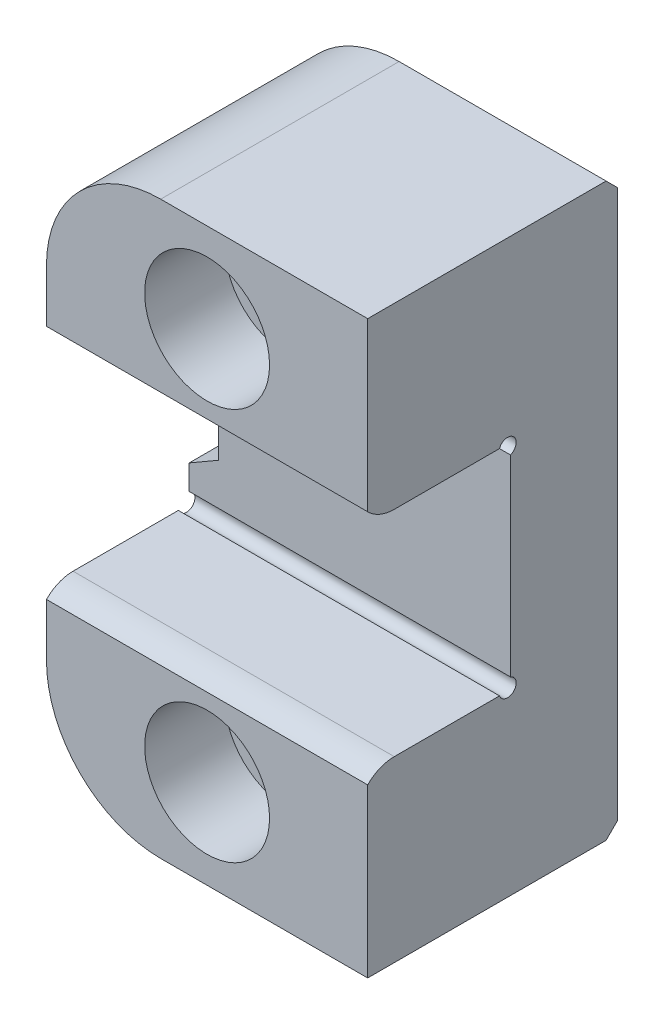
from build123d import *

# Parameters (mm, degrees)
EXTRUDE1_DEPTH             = 14.2875
FILLET1_R                  = 10.16
CUT_EXTRUDE1_DEPTH         = 41.411152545
CUT_EXTRUDE2_DEPTH         = 45.22263278
SKETCH6_R                  = 0.762
CUT_EXTRUDE3_DEPTH         = 45.22263278
F_1_4_20_CBORE_D           = 7.14248
F_1_4_20_CBORE_CBORE_D     = 11.1125
F_1_4_20_CBORE_CBORE_DEPTH = 7.14375
CHAMFER3_SIZE              = 3.81
CHAMFER3_SIZE2             = 1.020886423
CHAMFER1_SIZE              = 1.016


with BuildPart() as part:
    # Sketch1 → Extrude1 (new, symmetric)
    with BuildSketch(Plane(origin=(0, 0, 0), x_dir=(0, 0, -1), z_dir=(1, 0, 0))):
        Polygon((0, 9.525), (12.7, 9.525), (12.7, -9.525), (0, -9.525), (0, -25.4), (22.225, -25.4), (22.225, 25.4), (0, 25.4), align=None)
    extrude(amount=EXTRUDE1_DEPTH, both=True)

    # Fillet1
    fillet1_edges = [part.edges().sort_by_distance(p)[0] for p in [
        (-14.2875, 25.4, -11.1125),
        (-14.2875, -25.4, -11.1125),
    ]]
    fillet(fillet1_edges, radius=FILLET1_R)

    # Sketch2 → Cut-Extrude1 (cut, through all)
    with BuildSketch(Plane(origin=(-7.9375, 0, -22.225), x_dir=(1, 0, 0), z_dir=(0, 0, 1))):
        Polygon((-7.9375, 7.266543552), (-7.9375, -7.266543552), (-4.7625, -5.433456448), (-4.7625, 5.433456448), align=None)
    extrude(amount=CUT_EXTRUDE1_DEPTH, mode=Mode.SUBTRACT)

    # Sketch5 → Cut-Extrude2 (cut, through all)
    with BuildSketch(Plane(origin=(14.2875, 0, 0), x_dir=(0, 0, -1), z_dir=(1, 0, 0))):
        with BuildLine():
            Line((-3.9878, -7.346019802), (2.3622, -7.346019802))
            Line((2.3622, -7.346019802), (2.3622, -9.525))
            ThreePointArc((2.3622, -9.525), (1.080400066, -9.78418595), (0, -10.521019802))
            Line((0, -10.521019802), (-3.9878, -10.521019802))
            Line((-3.9878, -10.521019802), (-3.9878, -7.346019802))
        make_face()
        with BuildLine():
            Line((2.3622, 7.346019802), (2.3622, 9.525))
            ThreePointArc((2.3622, 9.525), (1.080400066, 9.78418595), (0, 10.521019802))
            Line((0, 10.521019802), (-3.9878, 10.521019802))
            Line((-3.9878, 10.521019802), (-3.9878, 7.346019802))
            Line((-3.9878, 7.346019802), (2.3622, 7.346019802))
        make_face()
    extrude(amount=-CUT_EXTRUDE2_DEPTH, mode=Mode.SUBTRACT)

    # Sketch6 → Cut-Extrude3 (cut, through all)
    with BuildSketch(Plane(origin=(14.2875, 0, 0), x_dir=(0, 0, -1), z_dir=(1, 0, 0))):
        with Locations((12.446, 9.271)):
            Circle(SKETCH6_R)
        with Locations((12.446, -9.271)):
            Circle(SKETCH6_R)
    extrude(amount=-CUT_EXTRUDE3_DEPTH, mode=Mode.SUBTRACT)

    # 1_4_-20 CBORE (through all)
    with Locations(Plane.XY):
        with Locations((0, 17.4625), (0, -17.4625)):
            CounterBoreHole(F_1_4_20_CBORE_D / 2, F_1_4_20_CBORE_CBORE_D / 2, F_1_4_20_CBORE_CBORE_DEPTH)

    # Chamfer3
    chamfer3_edges = [part.edges().sort_by_distance(p)[0] for p in [
        (-12.7, 0, -12.7),
    ]]
    chamfer3_side = [part.faces().sort_by_distance(p)[0] for p in [
        (-12.7, 0, -17.4625),
    ]]
    chamfer(chamfer3_edges, length=CHAMFER3_SIZE, length2=CHAMFER3_SIZE2, reference=chamfer3_side[0])

    # Chamfer1
    chamfer1_edges = [part.edges().sort_by_distance(p)[0] for p in [
        (5.08, 25.4, -22.225),
        (5.08, -25.4, -22.225),
        (-14.2875, -10.795, -22.225),
        (-11.311704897, 22.424204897, -22.225),
        (-11.311704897, -22.424204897, -22.225),
        (-14.2875, 10.795, -22.225),
    ]]
    chamfer(chamfer1_edges, length=CHAMFER1_SIZE)


solid = part.part
